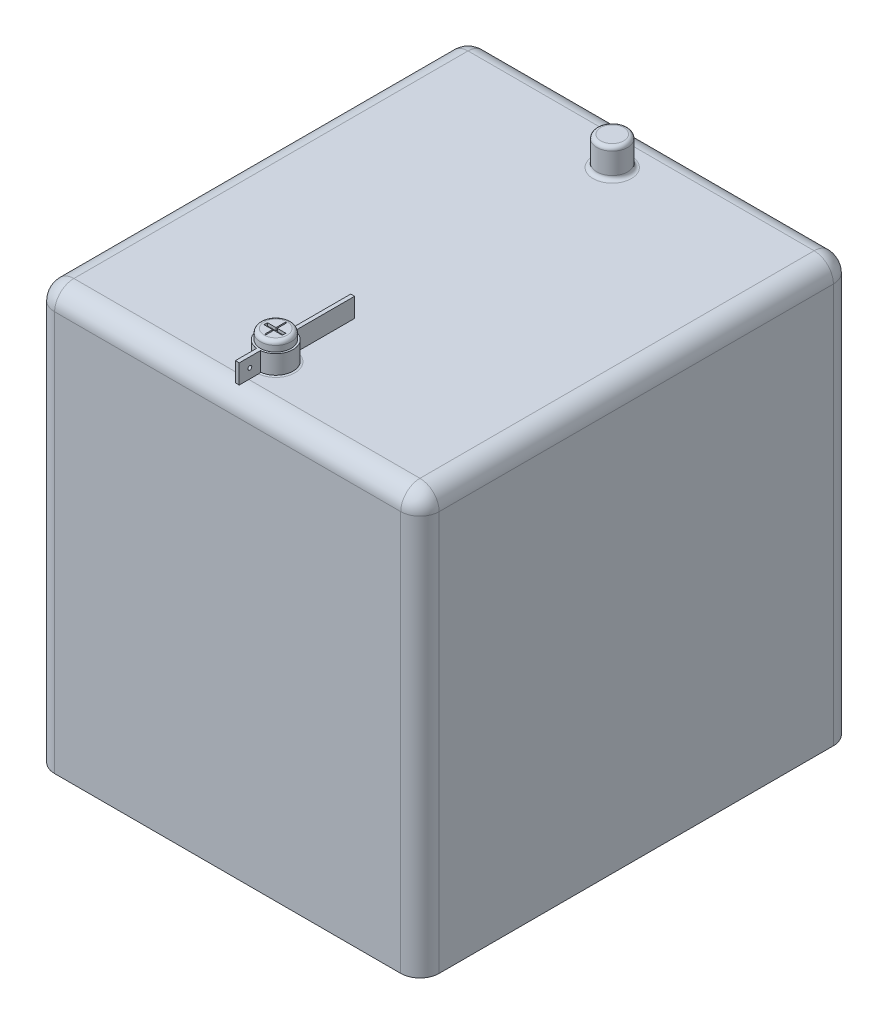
from build123d import *
from build123d.topology import SkipClean

# Parameters (mm, degrees)
SKETCH1_W          = 130
SKETCH1_H          = 218
EXTRUDE1_DEPTH     = 112.5
FILLET1_R          = 10
SKETCH4_R          = 8
EXTRUDE4_DEPTH     = 15
FILLET6_R          = 2
SKETCH5_W          = 1.869323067
SKETCH5_H          = 9.388155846
CUT_EXTRUDE1_DEPTH = 1.5
EXTRUDE5_DEPTH     = 10
SKETCH8_R          = 1
CUT_EXTRUDE2_DEPTH = 196.533245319


with BuildPart() as part:
    # Sketch1 → Extrude1 (new, symmetric)
    with BuildSketch(Plane.XY):
        Rectangle(SKETCH1_W, SKETCH1_H)
    extrude(amount=EXTRUDE1_DEPTH, both=True)

    # Fillet1
    fillet1_edges = [part.edges().sort_by_distance(p)[0] for p in [
        (65, 0, 112.5),
        (0, 109, 112.5),
        (-65, 0, 112.5),
        (0, 109, -112.5),
        (65, 0, -112.5),
        (-65, 0, -112.5),
        (-65, 109, 0),
        (65, 109, 0),
    ]]
    fillet(fillet1_edges, radius=FILLET1_R)

    # Sketch4 → Extrude4 (add)
    with BuildSketch(Plane(origin=(0, 109, 0), x_dir=(-1, 0, 0), z_dir=(0, 1, 0))):
        with Locations(Location((35, 87.5, 0), (0, 0, 180))):
            Circle(SKETCH4_R)
        with Locations(Location((35, -87.5, 0), (0, 0, 180))):
            Circle(SKETCH4_R)
    extrude(amount=EXTRUDE4_DEPTH)

    # Fillet6
    fillet6_edges = [part.edges().sort_by_distance(p)[0] for p in [
        (-43, 109, 87.5),
        (-43, 124, 87.5),
        (-43, 109, -87.5),
        (-43, 124, -87.5),
    ]]
    fillet(fillet6_edges, radius=FILLET6_R)

    # Sketch5 → Cut-Extrude1 (cut)
    with BuildSketch(Plane(origin=(0, 124, 0), x_dir=(-1, 0, 0), z_dir=(0, 1, 0))):
        Polygon((35.328219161, 87.044898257), (35.328219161, 82.143117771), (33.458896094, 82.143117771), (33.458896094, 87.044898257), (28.806358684, 87.044898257), (28.806358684, 88.872680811), (33.458896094, 88.872680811), (33.458896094, 92.943651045), (35.328219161, 92.943651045), (35.328219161, 88.872680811), (39.773054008, 88.872680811), (39.773054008, 87.044898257), align=None)
        with Locations((37.393557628, -87.28462066)):
            Rectangle(SKETCH5_W, SKETCH5_H)
    extrude(amount=-CUT_EXTRUDE1_DEPTH, mode=Mode.SUBTRACT)

    # Sketch7 → Extrude5 (add)
    with BuildSketch(Plane(origin=(0, 109, 0), x_dir=(1, 0, 0), z_dir=(0, 1, 0))):
        with BuildLine():
            Line((-35, -47.5), (-35, -79.5))
            ThreePointArc((-35, -79.5), (-27, -87.5), (-35, -95.5))
            Line((-35, -95.5), (-35, -107.5))
            Line((-35, -107.5), (-34, -107.5))
            Line((-34, -107.5), (-34, -96.44427191))
            ThreePointArc((-34, -96.44427191), (-26, -87.5), (-34, -78.55572809))
            Line((-34, -78.55572809), (-34, -47.5))
            Line((-34, -47.5), (-35, -47.5))
        make_face()
    extrude(amount=EXTRUDE5_DEPTH)

    # Mirror1: part across plane


with BuildPart() as part_1:
    with SkipClean():  # the faces are left unmerged after this step: merging them gives an invalid solid
        add(part.part)
        add(part.part.mirror(Plane(origin=(-35, 119, 47.5), x_dir=(0, 0, 1), z_dir=(1, 0, 0))))

    # Sketch8 → Cut-Extrude2 (cut, through all)
    with SkipClean():  # the faces are left unmerged after this step: merging them gives an invalid solid
        with BuildSketch(Plane.ZY.offset(36)):
            with Locations((101.972135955, 114)):
                Circle(SKETCH8_R)
        extrude(amount=-CUT_EXTRUDE2_DEPTH, mode=Mode.SUBTRACT)


solid = part_1.part
